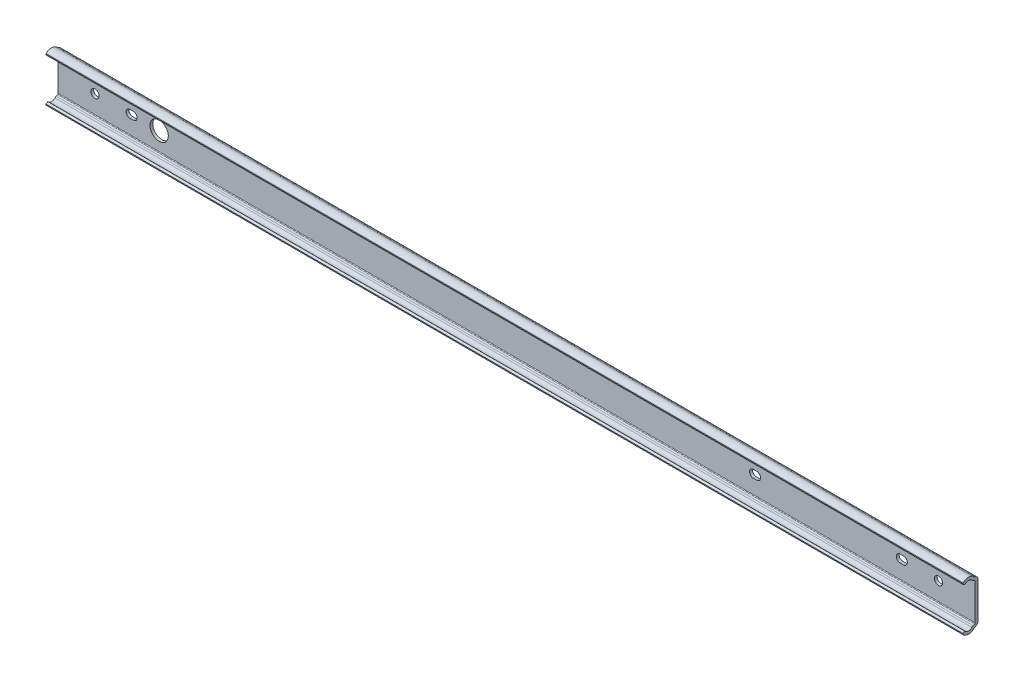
ISO-10303-21;
HEADER;
FILE_DESCRIPTION(('STEP AP214'),'2;1');
FILE_NAME('part.step','',(''),(''),'','','');
FILE_SCHEMA(('AUTOMOTIVE_DESIGN { 1 0 10303 214 1 1 1 1 }'));
ENDSEC;
DATA;
#1=APPLICATION_CONTEXT('core data for automotive mechanical design processes');
#2=APPLICATION_PROTOCOL_DEFINITION('international standard','automotive_design',2000,#1);
#3=PRODUCT_CONTEXT('',#1,'mechanical');
#4=PRODUCT('Part','Part','',(#3));
#5=PRODUCT_RELATED_PRODUCT_CATEGORY('part','',(#4));
#6=PRODUCT_DEFINITION_FORMATION('','',#4);
#7=PRODUCT_DEFINITION_CONTEXT('part definition',#1,'design');
#8=PRODUCT_DEFINITION('design','',#6,#7);
#9=PRODUCT_DEFINITION_SHAPE('','',#8);
#10=(LENGTH_UNIT() NAMED_UNIT(*) SI_UNIT(.MILLI.,.METRE.));
#11=(NAMED_UNIT(*) PLANE_ANGLE_UNIT() SI_UNIT($,.RADIAN.));
#12=(NAMED_UNIT(*) SI_UNIT($,.STERADIAN.) SOLID_ANGLE_UNIT());
#13=UNCERTAINTY_MEASURE_WITH_UNIT(LENGTH_MEASURE(1.E-05),#10,'distance_accuracy_value','');
#14=(GEOMETRIC_REPRESENTATION_CONTEXT(3) GLOBAL_UNCERTAINTY_ASSIGNED_CONTEXT((#13)) GLOBAL_UNIT_ASSIGNED_CONTEXT((#10,
#11,#12)) REPRESENTATION_CONTEXT('',''));
#15=CARTESIAN_POINT('',(0.,0.,0.));
#16=DIRECTION('',(0.,0.,1.));
#17=DIRECTION('',(1.,0.,0.));
#18=AXIS2_PLACEMENT_3D('',#15,#16,#17);
#19=CARTESIAN_POINT('',(-20.,-9.85313472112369,0.));
#20=DIRECTION('',(0.,0.,1.));
#21=DIRECTION('',(1.,0.,0.));
#22=AXIS2_PLACEMENT_3D('',#19,#20,#21);
#23=PLANE('',#22);
#24=DIRECTION('',(1.,0.,0.));
#25=VECTOR('',#24,1.);
#26=CARTESIAN_POINT('',(-20.,-2.10000022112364,0.));
#27=LINE('',#26,#25);
#28=CARTESIAN_POINT('',(439.1,-2.10000022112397,0.));
#29=VERTEX_POINT('',#28);
#30=CARTESIAN_POINT('',(440.9,-2.10000022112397,0.));
#31=VERTEX_POINT('',#30);
#32=EDGE_CURVE('E291',#29,#31,#27,.T.);
#33=ORIENTED_EDGE('',*,*,#32,.T.);
#34=CARTESIAN_POINT('',(440.9,-2.21123962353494E-07,0.));
#35=DIRECTION('',(0.,0.,1.));
#36=DIRECTION('',(1.,0.,0.));
#37=AXIS2_PLACEMENT_3D('',#34,#35,#36);
#38=CIRCLE('',#37,2.10000000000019);
#39=CARTESIAN_POINT('',(440.9,2.0999997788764,0.));
#40=VERTEX_POINT('',#39);
#41=EDGE_CURVE('E294',#31,#40,#38,.T.);
#42=ORIENTED_EDGE('',*,*,#41,.T.);
#43=DIRECTION('',(-1.,0.,0.));
#44=VECTOR('',#43,1.);
#45=CARTESIAN_POINT('',(-20.,2.09999977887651,0.));
#46=LINE('',#45,#44);
#47=CARTESIAN_POINT('',(439.1,2.0999997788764,0.));
#48=VERTEX_POINT('',#47);
#49=EDGE_CURVE('E286',#40,#48,#46,.T.);
#50=ORIENTED_EDGE('',*,*,#49,.T.);
#51=CARTESIAN_POINT('',(439.1,-2.2112396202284E-07,0.));
#52=DIRECTION('',(0.,0.,1.));
#53=DIRECTION('',(1.,0.,0.));
#54=AXIS2_PLACEMENT_3D('',#51,#52,#53);
#55=CIRCLE('',#54,2.10000000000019);
#56=EDGE_CURVE('E266',#48,#29,#55,.T.);
#57=ORIENTED_EDGE('',*,*,#56,.T.);
#58=EDGE_LOOP('',(#33,#42,#50,#57));
#59=FACE_BOUND('',#58,.T.);
#60=DIRECTION('',(1.,0.,0.));
#61=VECTOR('',#60,1.);
#62=CARTESIAN_POINT('',(-20.,-9.85313472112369,0.));
#63=LINE('',#62,#61);
#64=CARTESIAN_POINT('',(-20.,-9.85313472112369,0.));
#65=VERTEX_POINT('',#64);
#66=CARTESIAN_POINT('',(480.,-9.85313472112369,0.));
#67=VERTEX_POINT('',#66);
#68=EDGE_CURVE('E502',#65,#67,#63,.T.);
#69=ORIENTED_EDGE('',*,*,#68,.F.);
#70=DIRECTION('',(0.,-1.,0.));
#71=VECTOR('',#70,1.);
#72=CARTESIAN_POINT('',(-20.,-9.85313472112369,0.));
#73=LINE('',#72,#71);
#74=CARTESIAN_POINT('',(-20.,9.85313427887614,0.));
#75=VERTEX_POINT('',#74);
#76=EDGE_CURVE('E420',#75,#65,#73,.T.);
#77=ORIENTED_EDGE('',*,*,#76,.F.);
#78=DIRECTION('',(1.,0.,0.));
#79=VECTOR('',#78,1.);
#80=CARTESIAN_POINT('',(-20.,9.85313427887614,0.));
#81=LINE('',#80,#79);
#82=CARTESIAN_POINT('',(480.,9.85313427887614,0.));
#83=VERTEX_POINT('',#82);
#84=EDGE_CURVE('E505',#75,#83,#81,.T.);
#85=ORIENTED_EDGE('',*,*,#84,.T.);
#86=DIRECTION('',(0.,-1.,0.));
#87=VECTOR('',#86,1.);
#88=CARTESIAN_POINT('',(480.,-9.85313472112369,0.));
#89=LINE('',#88,#87);
#90=EDGE_CURVE('E367',#83,#67,#89,.T.);
#91=ORIENTED_EDGE('',*,*,#90,.T.);
#92=EDGE_LOOP('',(#69,#77,#85,#91));
#93=FACE_BOUND('',#92,.T.);
#94=CARTESIAN_POINT('',(35.,0.,0.));
#95=DIRECTION('',(0.,0.,-1.));
#96=DIRECTION('',(-1.,0.,0.));
#97=AXIS2_PLACEMENT_3D('',#94,#95,#96);
#98=CIRCLE('',#97,5.);
#99=CARTESIAN_POINT('',(30.,0.,0.));
#100=VERTEX_POINT('',#99);
#101=EDGE_CURVE('E297',#100,#100,#98,.T.);
#102=ORIENTED_EDGE('',*,*,#101,.F.);
#103=EDGE_LOOP('',(#102));
#104=FACE_BOUND('',#103,.T.);
#105=DIRECTION('',(-1.,0.,0.));
#106=VECTOR('',#105,1.);
#107=CARTESIAN_POINT('',(20.9,-2.1,0.));
#108=LINE('',#107,#106);
#109=CARTESIAN_POINT('',(20.9,-2.1,0.));
#110=VERTEX_POINT('',#109);
#111=CARTESIAN_POINT('',(19.1,-2.1,0.));
#112=VERTEX_POINT('',#111);
#113=EDGE_CURVE('E302',#110,#112,#108,.T.);
#114=ORIENTED_EDGE('',*,*,#113,.F.);
#115=CARTESIAN_POINT('',(20.9,0.,0.));
#116=DIRECTION('',(0.,0.,-1.));
#117=DIRECTION('',(-1.,0.,0.));
#118=AXIS2_PLACEMENT_3D('',#115,#116,#117);
#119=CIRCLE('',#118,2.1);
#120=CARTESIAN_POINT('',(20.9,2.1,0.));
#121=VERTEX_POINT('',#120);
#122=EDGE_CURVE('E300',#121,#110,#119,.T.);
#123=ORIENTED_EDGE('',*,*,#122,.F.);
#124=DIRECTION('',(1.,0.,0.));
#125=VECTOR('',#124,1.);
#126=CARTESIAN_POINT('',(20.9,2.1,0.));
#127=LINE('',#126,#125);
#128=CARTESIAN_POINT('',(19.1,2.1,0.));
#129=VERTEX_POINT('',#128);
#130=EDGE_CURVE('E308',#129,#121,#127,.T.);
#131=ORIENTED_EDGE('',*,*,#130,.F.);
#132=CARTESIAN_POINT('',(19.1,0.,0.));
#133=DIRECTION('',(0.,0.,-1.));
#134=DIRECTION('',(-1.,0.,0.));
#135=AXIS2_PLACEMENT_3D('',#132,#133,#134);
#136=CIRCLE('',#135,2.1);
#137=EDGE_CURVE('E305',#112,#129,#136,.T.);
#138=ORIENTED_EDGE('',*,*,#137,.F.);
#139=EDGE_LOOP('',(#114,#123,#131,#138));
#140=FACE_BOUND('',#139,.T.);
#141=DIRECTION('',(-1.,0.,0.));
#142=VECTOR('',#141,1.);
#143=CARTESIAN_POINT('',(360.9,-2.10000000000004,0.));
#144=LINE('',#143,#142);
#145=CARTESIAN_POINT('',(360.9,-2.10000000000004,0.));
#146=VERTEX_POINT('',#145);
#147=CARTESIAN_POINT('',(359.1,-2.10000000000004,0.));
#148=VERTEX_POINT('',#147);
#149=EDGE_CURVE('E322',#146,#148,#144,.T.);
#150=ORIENTED_EDGE('',*,*,#149,.F.);
#151=CARTESIAN_POINT('',(360.9,0.,0.));
#152=DIRECTION('',(0.,0.,-1.));
#153=DIRECTION('',(-1.,0.,0.));
#154=AXIS2_PLACEMENT_3D('',#151,#152,#153);
#155=CIRCLE('',#154,2.1);
#156=CARTESIAN_POINT('',(360.9,2.09999999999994,0.));
#157=VERTEX_POINT('',#156);
#158=EDGE_CURVE('E314',#157,#146,#155,.T.);
#159=ORIENTED_EDGE('',*,*,#158,.F.);
#160=DIRECTION('',(1.,0.,0.));
#161=VECTOR('',#160,1.);
#162=CARTESIAN_POINT('',(360.9,2.09999999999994,0.));
#163=LINE('',#162,#161);
#164=CARTESIAN_POINT('',(359.1,2.09999999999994,0.));
#165=VERTEX_POINT('',#164);
#166=EDGE_CURVE('E328',#165,#157,#163,.T.);
#167=ORIENTED_EDGE('',*,*,#166,.F.);
#168=CARTESIAN_POINT('',(359.1,0.,0.));
#169=DIRECTION('',(0.,0.,-1.));
#170=DIRECTION('',(-1.,0.,0.));
#171=AXIS2_PLACEMENT_3D('',#168,#169,#170);
#172=CIRCLE('',#171,2.1);
#173=EDGE_CURVE('E325',#148,#165,#172,.T.);
#174=ORIENTED_EDGE('',*,*,#173,.F.);
#175=EDGE_LOOP('',(#150,#159,#167,#174));
#176=FACE_BOUND('',#175,.T.);
#177=CARTESIAN_POINT('',(0.,0.,0.));
#178=DIRECTION('',(0.,0.,-1.));
#179=DIRECTION('',(-1.,0.,0.));
#180=AXIS2_PLACEMENT_3D('',#177,#178,#179);
#181=CIRCLE('',#180,2.24999999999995);
#182=CARTESIAN_POINT('',(-2.24999999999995,0.,0.));
#183=VERTEX_POINT('',#182);
#184=EDGE_CURVE('E334',#183,#183,#181,.T.);
#185=ORIENTED_EDGE('',*,*,#184,.F.);
#186=EDGE_LOOP('',(#185));
#187=FACE_BOUND('',#186,.T.);
#188=CARTESIAN_POINT('',(460.,0.,0.));
#189=DIRECTION('',(0.,0.,-1.));
#190=DIRECTION('',(-1.,0.,0.));
#191=AXIS2_PLACEMENT_3D('',#188,#189,#190);
#192=CIRCLE('',#191,2.25);
#193=CARTESIAN_POINT('',(457.75,0.,0.));
#194=VERTEX_POINT('',#193);
#195=EDGE_CURVE('E344',#194,#194,#192,.T.);
#196=ORIENTED_EDGE('',*,*,#195,.F.);
#197=EDGE_LOOP('',(#196));
#198=FACE_BOUND('',#197,.T.);
#199=ADVANCED_FACE('F14',(#59,#93,#104,#140,#176,#187,#198),#23,.F.);
#200=CARTESIAN_POINT('',(-20.,-9.85313472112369,1.54999999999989));
#201=DIRECTION('',(0.,0.,-1.));
#202=DIRECTION('',(-1.,0.,0.));
#203=AXIS2_PLACEMENT_3D('',#200,#201,#202);
#204=PLANE('',#203);
#205=DIRECTION('',(-1.,0.,0.));
#206=VECTOR('',#205,1.);
#207=CARTESIAN_POINT('',(440.9,2.0999997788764,1.54999999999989));
#208=LINE('',#207,#206);
#209=CARTESIAN_POINT('',(440.9,2.0999997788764,1.54999999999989));
#210=VERTEX_POINT('',#209);
#211=CARTESIAN_POINT('',(439.1,2.09999977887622,1.54999999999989));
#212=VERTEX_POINT('',#211);
#213=EDGE_CURVE('E272',#210,#212,#208,.T.);
#214=ORIENTED_EDGE('',*,*,#213,.F.);
#215=CARTESIAN_POINT('',(440.9,-2.21123962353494E-07,1.54999999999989));
#216=DIRECTION('',(0.,0.,1.));
#217=DIRECTION('',(1.,0.,0.));
#218=AXIS2_PLACEMENT_3D('',#215,#216,#217);
#219=CIRCLE('',#218,2.10000000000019);
#220=CARTESIAN_POINT('',(440.9,-2.10000022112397,1.54999999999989));
#221=VERTEX_POINT('',#220);
#222=EDGE_CURVE('E38',#221,#210,#219,.T.);
#223=ORIENTED_EDGE('',*,*,#222,.F.);
#224=DIRECTION('',(1.,0.,0.));
#225=VECTOR('',#224,1.);
#226=CARTESIAN_POINT('',(440.9,-2.10000022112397,1.54999999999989));
#227=LINE('',#226,#225);
#228=CARTESIAN_POINT('',(439.1,-2.10000022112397,1.54999999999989));
#229=VERTEX_POINT('',#228);
#230=EDGE_CURVE('E279',#229,#221,#227,.T.);
#231=ORIENTED_EDGE('',*,*,#230,.F.);
#232=CARTESIAN_POINT('',(439.1,-2.2112396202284E-07,1.54999999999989));
#233=DIRECTION('',(0.,0.,1.));
#234=DIRECTION('',(1.,0.,0.));
#235=AXIS2_PLACEMENT_3D('',#232,#233,#234);
#236=CIRCLE('',#235,2.10000000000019);
#237=EDGE_CURVE('E263',#212,#229,#236,.T.);
#238=ORIENTED_EDGE('',*,*,#237,.F.);
#239=EDGE_LOOP('',(#214,#223,#231,#238));
#240=FACE_BOUND('',#239,.T.);
#241=CARTESIAN_POINT('',(35.,0.,1.54999999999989));
#242=DIRECTION('',(0.,0.,-1.));
#243=DIRECTION('',(-1.,0.,0.));
#244=AXIS2_PLACEMENT_3D('',#241,#242,#243);
#245=CIRCLE('',#244,5.);
#246=CARTESIAN_POINT('',(30.,0.,1.54999999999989));
#247=VERTEX_POINT('',#246);
#248=EDGE_CURVE('E18',#247,#247,#245,.T.);
#249=ORIENTED_EDGE('',*,*,#248,.T.);
#250=EDGE_LOOP('',(#249));
#251=FACE_BOUND('',#250,.T.);
#252=DIRECTION('',(1.,0.,0.));
#253=VECTOR('',#252,1.);
#254=CARTESIAN_POINT('',(-20.,2.1,1.54999999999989));
#255=LINE('',#254,#253);
#256=CARTESIAN_POINT('',(19.1,2.1,1.54999999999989));
#257=VERTEX_POINT('',#256);
#258=CARTESIAN_POINT('',(20.9,2.1,1.54999999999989));
#259=VERTEX_POINT('',#258);
#260=EDGE_CURVE('E23',#257,#259,#255,.T.);
#261=ORIENTED_EDGE('',*,*,#260,.T.);
#262=CARTESIAN_POINT('',(20.9,0.,1.54999999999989));
#263=DIRECTION('',(0.,0.,-1.));
#264=DIRECTION('',(-1.,0.,0.));
#265=AXIS2_PLACEMENT_3D('',#262,#263,#264);
#266=CIRCLE('',#265,2.1);
#267=CARTESIAN_POINT('',(20.9,-2.1,1.54999999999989));
#268=VERTEX_POINT('',#267);
#269=EDGE_CURVE('E9',#259,#268,#266,.T.);
#270=ORIENTED_EDGE('',*,*,#269,.T.);
#271=DIRECTION('',(-1.,0.,0.));
#272=VECTOR('',#271,1.);
#273=CARTESIAN_POINT('',(-20.,-2.1,1.54999999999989));
#274=LINE('',#273,#272);
#275=CARTESIAN_POINT('',(19.1,-2.1,1.54999999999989));
#276=VERTEX_POINT('',#275);
#277=EDGE_CURVE('E548',#268,#276,#274,.T.);
#278=ORIENTED_EDGE('',*,*,#277,.T.);
#279=CARTESIAN_POINT('',(19.1,0.,1.54999999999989));
#280=DIRECTION('',(0.,0.,-1.));
#281=DIRECTION('',(-1.,0.,0.));
#282=AXIS2_PLACEMENT_3D('',#279,#280,#281);
#283=CIRCLE('',#282,2.1);
#284=EDGE_CURVE('E551',#276,#257,#283,.T.);
#285=ORIENTED_EDGE('',*,*,#284,.T.);
#286=EDGE_LOOP('',(#261,#270,#278,#285));
#287=FACE_BOUND('',#286,.T.);
#288=DIRECTION('',(1.,0.,0.));
#289=VECTOR('',#288,1.);
#290=CARTESIAN_POINT('',(-20.,2.09999999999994,1.54999999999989));
#291=LINE('',#290,#289);
#292=CARTESIAN_POINT('',(359.1,2.09999999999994,1.54999999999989));
#293=VERTEX_POINT('',#292);
#294=CARTESIAN_POINT('',(360.9,2.09999999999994,1.54999999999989));
#295=VERTEX_POINT('',#294);
#296=EDGE_CURVE('E542',#293,#295,#291,.T.);
#297=ORIENTED_EDGE('',*,*,#296,.T.);
#298=CARTESIAN_POINT('',(360.9,0.,1.54999999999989));
#299=DIRECTION('',(0.,0.,-1.));
#300=DIRECTION('',(-1.,0.,0.));
#301=AXIS2_PLACEMENT_3D('',#298,#299,#300);
#302=CIRCLE('',#301,2.1);
#303=CARTESIAN_POINT('',(360.9,-2.10000000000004,1.54999999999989));
#304=VERTEX_POINT('',#303);
#305=EDGE_CURVE('E545',#295,#304,#302,.T.);
#306=ORIENTED_EDGE('',*,*,#305,.T.);
#307=DIRECTION('',(-1.,0.,0.));
#308=VECTOR('',#307,1.);
#309=CARTESIAN_POINT('',(-20.,-2.10000000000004,1.54999999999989));
#310=LINE('',#309,#308);
#311=CARTESIAN_POINT('',(359.1,-2.10000000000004,1.54999999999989));
#312=VERTEX_POINT('',#311);
#313=EDGE_CURVE('E532',#304,#312,#310,.T.);
#314=ORIENTED_EDGE('',*,*,#313,.T.);
#315=CARTESIAN_POINT('',(359.1,0.,1.54999999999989));
#316=DIRECTION('',(0.,0.,-1.));
#317=DIRECTION('',(-1.,0.,0.));
#318=AXIS2_PLACEMENT_3D('',#315,#316,#317);
#319=CIRCLE('',#318,2.1);
#320=EDGE_CURVE('E539',#312,#293,#319,.T.);
#321=ORIENTED_EDGE('',*,*,#320,.T.);
#322=EDGE_LOOP('',(#297,#306,#314,#321));
#323=FACE_BOUND('',#322,.T.);
#324=CARTESIAN_POINT('',(0.,0.,1.54999999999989));
#325=DIRECTION('',(0.,0.,-1.));
#326=DIRECTION('',(-1.,0.,0.));
#327=AXIS2_PLACEMENT_3D('',#324,#325,#326);
#328=CIRCLE('',#327,2.24999999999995);
#329=CARTESIAN_POINT('',(-2.24999999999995,0.,1.54999999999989));
#330=VERTEX_POINT('',#329);
#331=EDGE_CURVE('E343',#330,#330,#328,.T.);
#332=ORIENTED_EDGE('',*,*,#331,.T.);
#333=EDGE_LOOP('',(#332));
#334=FACE_BOUND('',#333,.T.);
#335=CARTESIAN_POINT('',(460.,0.,1.54999999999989));
#336=DIRECTION('',(0.,0.,-1.));
#337=DIRECTION('',(-1.,0.,0.));
#338=AXIS2_PLACEMENT_3D('',#335,#336,#337);
#339=CIRCLE('',#338,2.25);
#340=CARTESIAN_POINT('',(457.75,0.,1.54999999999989));
#341=VERTEX_POINT('',#340);
#342=EDGE_CURVE('E347',#341,#341,#339,.T.);
#343=ORIENTED_EDGE('',*,*,#342,.T.);
#344=EDGE_LOOP('',(#343));
#345=FACE_BOUND('',#344,.T.);
#346=DIRECTION('',(1.,0.,0.));
#347=VECTOR('',#346,1.);
#348=CARTESIAN_POINT('',(-20.,9.85313427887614,1.54999999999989));
#349=LINE('',#348,#347);
#350=CARTESIAN_POINT('',(-20.,9.85313427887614,1.54999999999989));
#351=VERTEX_POINT('',#350);
#352=CARTESIAN_POINT('',(480.,9.85313427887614,1.54999999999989));
#353=VERTEX_POINT('',#352);
#354=EDGE_CURVE('E463',#351,#353,#349,.T.);
#355=ORIENTED_EDGE('',*,*,#354,.F.);
#356=DIRECTION('',(0.,1.,0.));
#357=VECTOR('',#356,1.);
#358=CARTESIAN_POINT('',(-20.,-9.85313472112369,1.54999999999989));
#359=LINE('',#358,#357);
#360=CARTESIAN_POINT('',(-20.,-9.85313472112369,1.54999999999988));
#361=VERTEX_POINT('',#360);
#362=EDGE_CURVE('E446',#361,#351,#359,.T.);
#363=ORIENTED_EDGE('',*,*,#362,.F.);
#364=DIRECTION('',(1.,0.,0.));
#365=VECTOR('',#364,1.);
#366=CARTESIAN_POINT('',(-20.,-9.85313472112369,1.54999999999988));
#367=LINE('',#366,#365);
#368=CARTESIAN_POINT('',(480.,-9.85313472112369,1.54999999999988));
#369=VERTEX_POINT('',#368);
#370=EDGE_CURVE('E466',#361,#369,#367,.T.);
#371=ORIENTED_EDGE('',*,*,#370,.T.);
#372=DIRECTION('',(0.,1.,0.));
#373=VECTOR('',#372,1.);
#374=CARTESIAN_POINT('',(480.,-9.85313472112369,1.54999999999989));
#375=LINE('',#374,#373);
#376=EDGE_CURVE('E393',#369,#353,#375,.T.);
#377=ORIENTED_EDGE('',*,*,#376,.T.);
#378=EDGE_LOOP('',(#355,#363,#371,#377));
#379=FACE_BOUND('',#378,.T.);
#380=ADVANCED_FACE('F276',(#240,#251,#287,#323,#334,#345,#379),#204,.F.);
#381=CARTESIAN_POINT('',(-20.,9.47,5.19000063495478));
#382=DIRECTION('',(-1.,0.,0.));
#383=DIRECTION('',(0.,0.,1.));
#384=AXIS2_PLACEMENT_3D('',#381,#382,#383);
#385=PLANE('',#384);
#386=ORIENTED_EDGE('',*,*,#362,.T.);
#387=CARTESIAN_POINT('',(-20.,9.85313427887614,2.05000034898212));
#388=DIRECTION('',(1.,0.,0.));
#389=DIRECTION('',(0.,0.,1.));
#390=AXIS2_PLACEMENT_3D('',#387,#388,#389);
#391=CIRCLE('',#390,0.500000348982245);
#392=CARTESIAN_POINT('',(-20.,10.3133869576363,1.85463448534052));
#393=VERTEX_POINT('',#392);
#394=EDGE_CURVE('E448',#351,#393,#391,.T.);
#395=ORIENTED_EDGE('',*,*,#394,.T.);
#396=DIRECTION('',(0.,0.39073096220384,0.920504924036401));
#397=VECTOR('',#396,1.);
#398=CARTESIAN_POINT('',(-20.,10.6566650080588,2.66334729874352));
#399=LINE('',#398,#397);
#400=CARTESIAN_POINT('',(-20.,10.6566650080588,2.66334729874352));
#401=VERTEX_POINT('',#400);
#402=EDGE_CURVE('E450',#393,#401,#399,.T.);
#403=ORIENTED_EDGE('',*,*,#402,.T.);
#404=CARTESIAN_POINT('',(-20.,12.5437002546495,1.86234835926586));
#405=DIRECTION('',(-1.,0.,0.));
#406=DIRECTION('',(0.,0.,1.));
#407=AXIS2_PLACEMENT_3D('',#404,#405,#406);
#408=CIRCLE('',#407,2.05000032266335);
#409=CARTESIAN_POINT('',(-20.,11.152732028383,3.36823969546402));
#410=VERTEX_POINT('',#409);
#411=EDGE_CURVE('E452',#401,#410,#408,.T.);
#412=ORIENTED_EDGE('',*,*,#411,.T.);
#413=CARTESIAN_POINT('',(-20.,9.47,5.19000063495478));
#414=DIRECTION('',(1.,0.,0.));
#415=DIRECTION('',(0.,0.,1.));
#416=AXIS2_PLACEMENT_3D('',#413,#414,#415);
#417=CIRCLE('',#416,2.48);
#418=CARTESIAN_POINT('',(-20.,11.2236248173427,6.94362545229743));
#419=VERTEX_POINT('',#418);
#420=EDGE_CURVE('E401',#410,#419,#417,.T.);
#421=ORIENTED_EDGE('',*,*,#420,.T.);
#422=DIRECTION('',(0.,-0.707107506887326,0.707106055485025));
#423=VECTOR('',#422,1.);
#424=CARTESIAN_POINT('',(-20.,11.2236248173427,6.94362545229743));
#425=LINE('',#424,#423);
#426=CARTESIAN_POINT('',(-20.,10.914413,7.2528366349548));
#427=VERTEX_POINT('',#426);
#428=EDGE_CURVE('E404',#419,#427,#425,.T.);
#429=ORIENTED_EDGE('',*,*,#428,.T.);
#430=DIRECTION('',(0.,0.573576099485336,0.819152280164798));
#431=VECTOR('',#430,1.);
#432=CARTESIAN_POINT('',(-20.,10.914413,7.2528366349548));
#433=LINE('',#432,#431);
#434=CARTESIAN_POINT('',(-20.,11.59863,8.23000063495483));
#435=VERTEX_POINT('',#434);
#436=EDGE_CURVE('E406',#427,#435,#433,.T.);
#437=ORIENTED_EDGE('',*,*,#436,.T.);
#438=DIRECTION('',(0.,1.,-2.09219452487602E-13));
#439=VECTOR('',#438,1.);
#440=CARTESIAN_POINT('',(-20.,12.1292799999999,8.23000063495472));
#441=LINE('',#440,#439);
#442=CARTESIAN_POINT('',(-20.,12.1292799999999,8.23000063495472));
#443=VERTEX_POINT('',#442);
#444=EDGE_CURVE('E408',#435,#443,#441,.T.);
#445=ORIENTED_EDGE('',*,*,#444,.T.);
#446=DIRECTION('',(0.,0.707108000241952,-0.707105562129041));
#447=VECTOR('',#446,1.);
#448=CARTESIAN_POINT('',(-20.,12.3196403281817,8.03964096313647));
#449=LINE('',#448,#447);
#450=CARTESIAN_POINT('',(-20.,12.3196403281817,8.03964096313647));
#451=VERTEX_POINT('',#450);
#452=EDGE_CURVE('E410',#443,#451,#449,.T.);
#453=ORIENTED_EDGE('',*,*,#452,.T.);
#454=CARTESIAN_POINT('',(-20.,9.47,5.19000063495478));
#455=DIRECTION('',(-1.,0.,0.));
#456=DIRECTION('',(0.,0.,1.));
#457=AXIS2_PLACEMENT_3D('',#454,#455,#456);
#458=CIRCLE('',#457,4.02999999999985);
#459=CARTESIAN_POINT('',(-20.,12.2044395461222,2.22963910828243));
#460=VERTEX_POINT('',#459);
#461=EDGE_CURVE('E412',#451,#460,#458,.T.);
#462=ORIENTED_EDGE('',*,*,#461,.T.);
#463=CARTESIAN_POINT('',(-20.,12.5437002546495,1.86234835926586));
#464=DIRECTION('',(1.,0.,0.));
#465=DIRECTION('',(0.,0.,1.));
#466=AXIS2_PLACEMENT_3D('',#463,#464,#465);
#467=CIRCLE('',#466,0.500000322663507);
#468=CARTESIAN_POINT('',(-20.,12.0834476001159,2.05771421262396));
#469=VERTEX_POINT('',#468);
#470=EDGE_CURVE('E414',#460,#469,#467,.T.);
#471=ORIENTED_EDGE('',*,*,#470,.T.);
#472=DIRECTION('',(0.,-0.39073096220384,-0.920504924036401));
#473=VECTOR('',#472,1.);
#474=CARTESIAN_POINT('',(-20.,12.0834476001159,2.05771421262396));
#475=LINE('',#474,#473);
#476=CARTESIAN_POINT('',(-20.,11.7401695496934,1.24900139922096));
#477=VERTEX_POINT('',#476);
#478=EDGE_CURVE('E416',#469,#477,#475,.T.);
#479=ORIENTED_EDGE('',*,*,#478,.T.);
#480=CARTESIAN_POINT('',(-20.,9.85313427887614,2.05000034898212));
#481=DIRECTION('',(-1.,0.,0.));
#482=DIRECTION('',(0.,0.,1.));
#483=AXIS2_PLACEMENT_3D('',#480,#481,#482);
#484=CIRCLE('',#483,2.05000034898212);
#485=EDGE_CURVE('E418',#477,#75,#484,.T.);
#486=ORIENTED_EDGE('',*,*,#485,.T.);
#487=ORIENTED_EDGE('',*,*,#76,.T.);
#488=CARTESIAN_POINT('',(-20.,-9.85313472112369,2.05000034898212));
#489=DIRECTION('',(-1.,0.,0.));
#490=DIRECTION('',(0.,0.,-1.));
#491=AXIS2_PLACEMENT_3D('',#488,#489,#490);
#492=CIRCLE('',#491,2.05000034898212);
#493=CARTESIAN_POINT('',(-20.,-11.7401699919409,1.24900139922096));
#494=VERTEX_POINT('',#493);
#495=EDGE_CURVE('E422',#65,#494,#492,.T.);
#496=ORIENTED_EDGE('',*,*,#495,.T.);
#497=DIRECTION('',(0.,-0.39073096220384,0.920504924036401));
#498=VECTOR('',#497,1.);
#499=CARTESIAN_POINT('',(-20.,-12.0834480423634,2.05771421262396));
#500=LINE('',#499,#498);
#501=CARTESIAN_POINT('',(-20.,-12.0834480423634,2.05771421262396));
#502=VERTEX_POINT('',#501);
#503=EDGE_CURVE('E424',#494,#502,#500,.T.);
#504=ORIENTED_EDGE('',*,*,#503,.T.);
#505=CARTESIAN_POINT('',(-20.,-12.5437006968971,1.86234835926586));
#506=DIRECTION('',(1.,0.,0.));
#507=DIRECTION('',(0.,0.,-1.));
#508=AXIS2_PLACEMENT_3D('',#505,#506,#507);
#509=CIRCLE('',#508,0.500000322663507);
#510=CARTESIAN_POINT('',(-20.,-12.2044399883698,2.22963910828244));
#511=VERTEX_POINT('',#510);
#512=EDGE_CURVE('E426',#502,#511,#509,.T.);
#513=ORIENTED_EDGE('',*,*,#512,.T.);
#514=CARTESIAN_POINT('',(-20.,-9.4700004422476,5.19000063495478));
#515=DIRECTION('',(-1.,0.,0.));
#516=DIRECTION('',(0.,0.,-1.));
#517=AXIS2_PLACEMENT_3D('',#514,#515,#516);
#518=CIRCLE('',#517,4.02999999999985);
#519=CARTESIAN_POINT('',(-20.,-12.3196407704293,8.03964096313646));
#520=VERTEX_POINT('',#519);
#521=EDGE_CURVE('E428',#511,#520,#518,.T.);
#522=ORIENTED_EDGE('',*,*,#521,.T.);
#523=DIRECTION('',(0.,0.707108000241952,0.707105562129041));
#524=VECTOR('',#523,1.);
#525=CARTESIAN_POINT('',(-20.,-12.3196407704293,8.03964096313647));
#526=LINE('',#525,#524);
#527=CARTESIAN_POINT('',(-20.,-12.1292804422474,8.23000063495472));
#528=VERTEX_POINT('',#527);
#529=EDGE_CURVE('E430',#520,#528,#526,.T.);
#530=ORIENTED_EDGE('',*,*,#529,.T.);
#531=DIRECTION('',(0.,1.,2.09219452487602E-13));
#532=VECTOR('',#531,1.);
#533=CARTESIAN_POINT('',(-20.,-12.1292804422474,8.23000063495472));
#534=LINE('',#533,#532);
#535=CARTESIAN_POINT('',(-20.,-11.5986304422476,8.23000063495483));
#536=VERTEX_POINT('',#535);
#537=EDGE_CURVE('E432',#528,#536,#534,.T.);
#538=ORIENTED_EDGE('',*,*,#537,.T.);
#539=DIRECTION('',(0.,0.573576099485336,-0.819152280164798));
#540=VECTOR('',#539,1.);
#541=CARTESIAN_POINT('',(-20.,-10.9144134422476,7.2528366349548));
#542=LINE('',#541,#540);
#543=CARTESIAN_POINT('',(-20.,-10.9144134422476,7.2528366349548));
#544=VERTEX_POINT('',#543);
#545=EDGE_CURVE('E434',#536,#544,#542,.T.);
#546=ORIENTED_EDGE('',*,*,#545,.T.);
#547=DIRECTION('',(0.,-0.707107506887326,-0.707106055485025));
#548=VECTOR('',#547,1.);
#549=CARTESIAN_POINT('',(-20.,-11.2236252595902,6.94362545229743));
#550=LINE('',#549,#548);
#551=CARTESIAN_POINT('',(-20.,-11.2236252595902,6.94362545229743));
#552=VERTEX_POINT('',#551);
#553=EDGE_CURVE('E436',#544,#552,#550,.T.);
#554=ORIENTED_EDGE('',*,*,#553,.T.);
#555=CARTESIAN_POINT('',(-20.,-9.4700004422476,5.19000063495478));
#556=DIRECTION('',(1.,0.,0.));
#557=DIRECTION('',(0.,0.,-1.));
#558=AXIS2_PLACEMENT_3D('',#555,#556,#557);
#559=CIRCLE('',#558,2.48);
#560=CARTESIAN_POINT('',(-20.,-11.1527324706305,3.36823969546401));
#561=VERTEX_POINT('',#560);
#562=EDGE_CURVE('E438',#552,#561,#559,.T.);
#563=ORIENTED_EDGE('',*,*,#562,.T.);
#564=CARTESIAN_POINT('',(-20.,-12.5437006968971,1.86234835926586));
#565=DIRECTION('',(-1.,0.,0.));
#566=DIRECTION('',(0.,0.,-1.));
#567=AXIS2_PLACEMENT_3D('',#564,#565,#566);
#568=CIRCLE('',#567,2.05000032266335);
#569=CARTESIAN_POINT('',(-20.,-10.6566654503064,2.66334729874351));
#570=VERTEX_POINT('',#569);
#571=EDGE_CURVE('E440',#561,#570,#568,.T.);
#572=ORIENTED_EDGE('',*,*,#571,.T.);
#573=DIRECTION('',(0.,0.39073096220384,-0.920504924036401));
#574=VECTOR('',#573,1.);
#575=CARTESIAN_POINT('',(-20.,-10.6566654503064,2.66334729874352));
#576=LINE('',#575,#574);
#577=CARTESIAN_POINT('',(-20.,-10.3133873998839,1.85463448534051));
#578=VERTEX_POINT('',#577);
#579=EDGE_CURVE('E442',#570,#578,#576,.T.);
#580=ORIENTED_EDGE('',*,*,#579,.T.);
#581=CARTESIAN_POINT('',(-20.,-9.85313472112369,2.05000034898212));
#582=DIRECTION('',(1.,0.,0.));
#583=DIRECTION('',(0.,0.,-1.));
#584=AXIS2_PLACEMENT_3D('',#581,#582,#583);
#585=CIRCLE('',#584,0.500000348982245);
#586=EDGE_CURVE('E444',#578,#361,#585,.T.);
#587=ORIENTED_EDGE('',*,*,#586,.T.);
#588=EDGE_LOOP('',(#386,#395,#403,#412,#421,#429,#437,#445,#453,#462,#471,#479,#486,#487,#496,
#504,#513,#522,#530,#538,#546,#554,#563,#572,#580,#587));
#589=FACE_BOUND('',#588,.T.);
#590=ADVANCED_FACE('F596',(#589),#385,.T.);
#591=CARTESIAN_POINT('',(-20.,9.47,5.19000063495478));
#592=DIRECTION('',(1.,0.,0.));
#593=DIRECTION('',(0.,0.,-1.));
#594=AXIS2_PLACEMENT_3D('',#591,#592,#593);
#595=CYLINDRICAL_SURFACE('',#594,2.48);
#596=CARTESIAN_POINT('',(480.,9.47,5.19000063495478));
#597=DIRECTION('',(1.,0.,0.));
#598=DIRECTION('',(0.,0.,1.));
#599=AXIS2_PLACEMENT_3D('',#596,#597,#598);
#600=CIRCLE('',#599,2.48);
#601=CARTESIAN_POINT('',(480.,11.152732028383,3.36823969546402));
#602=VERTEX_POINT('',#601);
#603=CARTESIAN_POINT('',(480.,11.2236248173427,6.94362545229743));
#604=VERTEX_POINT('',#603);
#605=EDGE_CURVE('E348',#602,#604,#600,.T.);
#606=ORIENTED_EDGE('',*,*,#605,.T.);
#607=DIRECTION('',(1.,0.,0.));
#608=VECTOR('',#607,1.);
#609=CARTESIAN_POINT('',(-20.,11.2236248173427,6.94362545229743));
#610=LINE('',#609,#608);
#611=EDGE_CURVE('E529',#419,#604,#610,.T.);
#612=ORIENTED_EDGE('',*,*,#611,.F.);
#613=ORIENTED_EDGE('',*,*,#420,.F.);
#614=DIRECTION('',(1.,0.,0.));
#615=VECTOR('',#614,1.);
#616=CARTESIAN_POINT('',(-20.,11.152732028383,3.36823969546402));
#617=LINE('',#616,#615);
#618=EDGE_CURVE('E454',#410,#602,#617,.T.);
#619=ORIENTED_EDGE('',*,*,#618,.T.);
#620=EDGE_LOOP('',(#606,#612,#613,#619));
#621=FACE_BOUND('',#620,.T.);
#622=ADVANCED_FACE('F16',(#621),#595,.F.);
#623=CARTESIAN_POINT('',(-20.,11.2236248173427,6.94362545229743));
#624=DIRECTION('',(0.,0.707106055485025,0.707107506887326));
#625=DIRECTION('',(0.,0.707107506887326,-0.707106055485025));
#626=AXIS2_PLACEMENT_3D('',#623,#624,#625);
#627=PLANE('',#626);
#628=DIRECTION('',(0.,-0.707107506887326,0.707106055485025));
#629=VECTOR('',#628,1.);
#630=CARTESIAN_POINT('',(480.,11.2236248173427,6.94362545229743));
#631=LINE('',#630,#629);
#632=CARTESIAN_POINT('',(480.,10.914413,7.2528366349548));
#633=VERTEX_POINT('',#632);
#634=EDGE_CURVE('E351',#604,#633,#631,.T.);
#635=ORIENTED_EDGE('',*,*,#634,.T.);
#636=DIRECTION('',(1.,0.,0.));
#637=VECTOR('',#636,1.);
#638=CARTESIAN_POINT('',(-20.,10.914413,7.2528366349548));
#639=LINE('',#638,#637);
#640=EDGE_CURVE('E526',#427,#633,#639,.T.);
#641=ORIENTED_EDGE('',*,*,#640,.F.);
#642=ORIENTED_EDGE('',*,*,#428,.F.);
#643=ORIENTED_EDGE('',*,*,#611,.T.);
#644=EDGE_LOOP('',(#635,#641,#642,#643));
#645=FACE_BOUND('',#644,.T.);
#646=ADVANCED_FACE('F629',(#645),#627,.F.);
#647=CARTESIAN_POINT('',(-20.,10.914413,7.2528366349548));
#648=DIRECTION('',(0.,0.819152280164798,-0.573576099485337));
#649=DIRECTION('',(0.,-0.573576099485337,-0.819152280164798));
#650=AXIS2_PLACEMENT_3D('',#647,#648,#649);
#651=PLANE('',#650);
#652=DIRECTION('',(0.,0.573576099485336,0.819152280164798));
#653=VECTOR('',#652,1.);
#654=CARTESIAN_POINT('',(480.,10.914413,7.2528366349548));
#655=LINE('',#654,#653);
#656=CARTESIAN_POINT('',(480.,11.59863,8.23000063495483));
#657=VERTEX_POINT('',#656);
#658=EDGE_CURVE('E353',#633,#657,#655,.T.);
#659=ORIENTED_EDGE('',*,*,#658,.T.);
#660=DIRECTION('',(1.,0.,0.));
#661=VECTOR('',#660,1.);
#662=CARTESIAN_POINT('',(-20.,11.59863,8.23000063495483));
#663=LINE('',#662,#661);
#664=EDGE_CURVE('E523',#435,#657,#663,.T.);
#665=ORIENTED_EDGE('',*,*,#664,.F.);
#666=ORIENTED_EDGE('',*,*,#436,.F.);
#667=ORIENTED_EDGE('',*,*,#640,.T.);
#668=EDGE_LOOP('',(#659,#665,#666,#667));
#669=FACE_BOUND('',#668,.T.);
#670=ADVANCED_FACE('F626',(#669),#651,.F.);
#671=CARTESIAN_POINT('',(-20.,12.1292799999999,8.23000063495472));
#672=DIRECTION('',(0.,-2.09219452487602E-13,-1.));
#673=DIRECTION('',(0.,-1.,2.09219452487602E-13));
#674=AXIS2_PLACEMENT_3D('',#671,#672,#673);
#675=PLANE('',#674);
#676=DIRECTION('',(0.,1.,-2.09219452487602E-13));
#677=VECTOR('',#676,1.);
#678=CARTESIAN_POINT('',(480.,12.1292799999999,8.23000063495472));
#679=LINE('',#678,#677);
#680=CARTESIAN_POINT('',(480.,12.1292799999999,8.23000063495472));
#681=VERTEX_POINT('',#680);
#682=EDGE_CURVE('E355',#657,#681,#679,.T.);
#683=ORIENTED_EDGE('',*,*,#682,.T.);
#684=DIRECTION('',(1.,0.,0.));
#685=VECTOR('',#684,1.);
#686=CARTESIAN_POINT('',(-20.,12.1292799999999,8.23000063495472));
#687=LINE('',#686,#685);
#688=EDGE_CURVE('E520',#443,#681,#687,.T.);
#689=ORIENTED_EDGE('',*,*,#688,.F.);
#690=ORIENTED_EDGE('',*,*,#444,.F.);
#691=ORIENTED_EDGE('',*,*,#664,.T.);
#692=EDGE_LOOP('',(#683,#689,#690,#691));
#693=FACE_BOUND('',#692,.T.);
#694=ADVANCED_FACE('F622',(#693),#675,.F.);
#695=CARTESIAN_POINT('',(-20.,12.3196403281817,8.03964096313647));
#696=DIRECTION('',(0.,-0.707105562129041,-0.707108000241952));
#697=DIRECTION('',(0.,-0.707108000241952,0.707105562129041));
#698=AXIS2_PLACEMENT_3D('',#695,#696,#697);
#699=PLANE('',#698);
#700=DIRECTION('',(0.,0.707108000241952,-0.707105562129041));
#701=VECTOR('',#700,1.);
#702=CARTESIAN_POINT('',(480.,12.3196403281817,8.03964096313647));
#703=LINE('',#702,#701);
#704=CARTESIAN_POINT('',(480.,12.3196403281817,8.03964096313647));
#705=VERTEX_POINT('',#704);
#706=EDGE_CURVE('E357',#681,#705,#703,.T.);
#707=ORIENTED_EDGE('',*,*,#706,.T.);
#708=DIRECTION('',(1.,0.,0.));
#709=VECTOR('',#708,1.);
#710=CARTESIAN_POINT('',(-20.,12.3196403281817,8.03964096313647));
#711=LINE('',#710,#709);
#712=EDGE_CURVE('E517',#451,#705,#711,.T.);
#713=ORIENTED_EDGE('',*,*,#712,.F.);
#714=ORIENTED_EDGE('',*,*,#452,.F.);
#715=ORIENTED_EDGE('',*,*,#688,.T.);
#716=EDGE_LOOP('',(#707,#713,#714,#715));
#717=FACE_BOUND('',#716,.T.);
#718=ADVANCED_FACE('F618',(#717),#699,.F.);
#719=CARTESIAN_POINT('',(-20.,9.47,5.19000063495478));
#720=DIRECTION('',(1.,0.,0.));
#721=DIRECTION('',(0.,0.,-1.));
#722=AXIS2_PLACEMENT_3D('',#719,#720,#721);
#723=CYLINDRICAL_SURFACE('',#722,4.02999999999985);
#724=DIRECTION('',(1.,0.,0.));
#725=VECTOR('',#724,1.);
#726=CARTESIAN_POINT('',(-20.,12.2044395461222,2.22963910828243));
#727=LINE('',#726,#725);
#728=CARTESIAN_POINT('',(480.,12.2044395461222,2.22963910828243));
#729=VERTEX_POINT('',#728);
#730=EDGE_CURVE('E514',#460,#729,#727,.T.);
#731=ORIENTED_EDGE('',*,*,#730,.F.);
#732=ORIENTED_EDGE('',*,*,#461,.F.);
#733=ORIENTED_EDGE('',*,*,#712,.T.);
#734=CARTESIAN_POINT('',(480.,9.47,5.19000063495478));
#735=DIRECTION('',(-1.,0.,0.));
#736=DIRECTION('',(0.,0.,1.));
#737=AXIS2_PLACEMENT_3D('',#734,#735,#736);
#738=CIRCLE('',#737,4.02999999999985);
#739=EDGE_CURVE('E359',#705,#729,#738,.T.);
#740=ORIENTED_EDGE('',*,*,#739,.T.);
#741=EDGE_LOOP('',(#731,#732,#733,#740));
#742=FACE_BOUND('',#741,.T.);
#743=ADVANCED_FACE('F614',(#742),#723,.T.);
#744=CARTESIAN_POINT('',(-20.,12.5437002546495,1.86234835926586));
#745=DIRECTION('',(1.,0.,0.));
#746=DIRECTION('',(0.,0.,-1.));
#747=AXIS2_PLACEMENT_3D('',#744,#745,#746);
#748=CYLINDRICAL_SURFACE('',#747,0.500000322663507);
#749=CARTESIAN_POINT('',(480.,12.5437002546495,1.86234835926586));
#750=DIRECTION('',(1.,0.,0.));
#751=DIRECTION('',(0.,0.,1.));
#752=AXIS2_PLACEMENT_3D('',#749,#750,#751);
#753=CIRCLE('',#752,0.500000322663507);
#754=CARTESIAN_POINT('',(480.,12.0834476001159,2.05771421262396));
#755=VERTEX_POINT('',#754);
#756=EDGE_CURVE('E361',#729,#755,#753,.T.);
#757=ORIENTED_EDGE('',*,*,#756,.T.);
#758=DIRECTION('',(1.,0.,0.));
#759=VECTOR('',#758,1.);
#760=CARTESIAN_POINT('',(-20.,12.0834476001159,2.05771421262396));
#761=LINE('',#760,#759);
#762=EDGE_CURVE('E511',#469,#755,#761,.T.);
#763=ORIENTED_EDGE('',*,*,#762,.F.);
#764=ORIENTED_EDGE('',*,*,#470,.F.);
#765=ORIENTED_EDGE('',*,*,#730,.T.);
#766=EDGE_LOOP('',(#757,#763,#764,#765));
#767=FACE_BOUND('',#766,.T.);
#768=ADVANCED_FACE('F610',(#767),#748,.F.);
#769=CARTESIAN_POINT('',(-20.,12.0834476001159,2.05771421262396));
#770=DIRECTION('',(0.,-0.920504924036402,0.390730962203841));
#771=DIRECTION('',(0.,0.390730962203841,0.920504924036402));
#772=AXIS2_PLACEMENT_3D('',#769,#770,#771);
#773=PLANE('',#772);
#774=DIRECTION('',(0.,-0.39073096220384,-0.920504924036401));
#775=VECTOR('',#774,1.);
#776=CARTESIAN_POINT('',(480.,12.0834476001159,2.05771421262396));
#777=LINE('',#776,#775);
#778=CARTESIAN_POINT('',(480.,11.7401695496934,1.24900139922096));
#779=VERTEX_POINT('',#778);
#780=EDGE_CURVE('E363',#755,#779,#777,.T.);
#781=ORIENTED_EDGE('',*,*,#780,.T.);
#782=DIRECTION('',(1.,0.,0.));
#783=VECTOR('',#782,1.);
#784=CARTESIAN_POINT('',(-20.,11.7401695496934,1.24900139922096));
#785=LINE('',#784,#783);
#786=EDGE_CURVE('E508',#477,#779,#785,.T.);
#787=ORIENTED_EDGE('',*,*,#786,.F.);
#788=ORIENTED_EDGE('',*,*,#478,.F.);
#789=ORIENTED_EDGE('',*,*,#762,.T.);
#790=EDGE_LOOP('',(#781,#787,#788,#789));
#791=FACE_BOUND('',#790,.T.);
#792=ADVANCED_FACE('F606',(#791),#773,.F.);
#793=CARTESIAN_POINT('',(-20.,9.85313427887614,2.05000034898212));
#794=DIRECTION('',(1.,0.,0.));
#795=DIRECTION('',(0.,0.,-1.));
#796=AXIS2_PLACEMENT_3D('',#793,#794,#795);
#797=CYLINDRICAL_SURFACE('',#796,2.05000034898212);
#798=CARTESIAN_POINT('',(480.,9.85313427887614,2.05000034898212));
#799=DIRECTION('',(-1.,0.,0.));
#800=DIRECTION('',(0.,0.,1.));
#801=AXIS2_PLACEMENT_3D('',#798,#799,#800);
#802=CIRCLE('',#801,2.05000034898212);
#803=EDGE_CURVE('E365',#779,#83,#802,.T.);
#804=ORIENTED_EDGE('',*,*,#803,.T.);
#805=ORIENTED_EDGE('',*,*,#84,.F.);
#806=ORIENTED_EDGE('',*,*,#485,.F.);
#807=ORIENTED_EDGE('',*,*,#786,.T.);
#808=EDGE_LOOP('',(#804,#805,#806,#807));
#809=FACE_BOUND('',#808,.T.);
#810=ADVANCED_FACE('F603',(#809),#797,.T.);
#811=CARTESIAN_POINT('',(-20.,-9.85313472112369,2.05000034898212));
#812=DIRECTION('',(1.,0.,0.));
#813=DIRECTION('',(0.,0.,-1.));
#814=AXIS2_PLACEMENT_3D('',#811,#812,#813);
#815=CYLINDRICAL_SURFACE('',#814,2.05000034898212);
#816=CARTESIAN_POINT('',(480.,-9.85313472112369,2.05000034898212));
#817=DIRECTION('',(-1.,0.,0.));
#818=DIRECTION('',(0.,0.,-1.));
#819=AXIS2_PLACEMENT_3D('',#816,#817,#818);
#820=CIRCLE('',#819,2.05000034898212);
#821=CARTESIAN_POINT('',(480.,-11.7401699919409,1.24900139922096));
#822=VERTEX_POINT('',#821);
#823=EDGE_CURVE('E369',#67,#822,#820,.T.);
#824=ORIENTED_EDGE('',*,*,#823,.T.);
#825=DIRECTION('',(1.,0.,0.));
#826=VECTOR('',#825,1.);
#827=CARTESIAN_POINT('',(-20.,-11.7401699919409,1.24900139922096));
#828=LINE('',#827,#826);
#829=EDGE_CURVE('E499',#494,#822,#828,.T.);
#830=ORIENTED_EDGE('',*,*,#829,.F.);
#831=ORIENTED_EDGE('',*,*,#495,.F.);
#832=ORIENTED_EDGE('',*,*,#68,.T.);
#833=EDGE_LOOP('',(#824,#830,#831,#832));
#834=FACE_BOUND('',#833,.T.);
#835=ADVANCED_FACE('F601',(#834),#815,.T.);
#836=CARTESIAN_POINT('',(-20.,-12.0834480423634,2.05771421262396));
#837=DIRECTION('',(0.,0.920504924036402,0.390730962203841));
#838=DIRECTION('',(0.,0.390730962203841,-0.920504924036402));
#839=AXIS2_PLACEMENT_3D('',#836,#837,#838);
#840=PLANE('',#839);
#841=DIRECTION('',(0.,-0.39073096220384,0.920504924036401));
#842=VECTOR('',#841,1.);
#843=CARTESIAN_POINT('',(480.,-12.0834480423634,2.05771421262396));
#844=LINE('',#843,#842);
#845=CARTESIAN_POINT('',(480.,-12.0834480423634,2.05771421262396));
#846=VERTEX_POINT('',#845);
#847=EDGE_CURVE('E371',#822,#846,#844,.T.);
#848=ORIENTED_EDGE('',*,*,#847,.T.);
#849=DIRECTION('',(1.,0.,0.));
#850=VECTOR('',#849,1.);
#851=CARTESIAN_POINT('',(-20.,-12.0834480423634,2.05771421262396));
#852=LINE('',#851,#850);
#853=EDGE_CURVE('E496',#502,#846,#852,.T.);
#854=ORIENTED_EDGE('',*,*,#853,.F.);
#855=ORIENTED_EDGE('',*,*,#503,.F.);
#856=ORIENTED_EDGE('',*,*,#829,.T.);
#857=EDGE_LOOP('',(#848,#854,#855,#856));
#858=FACE_BOUND('',#857,.T.);
#859=ADVANCED_FACE('F730',(#858),#840,.F.);
#860=CARTESIAN_POINT('',(-20.,-12.5437006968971,1.86234835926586));
#861=DIRECTION('',(1.,0.,0.));
#862=DIRECTION('',(0.,0.,-1.));
#863=AXIS2_PLACEMENT_3D('',#860,#861,#862);
#864=CYLINDRICAL_SURFACE('',#863,0.500000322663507);
#865=CARTESIAN_POINT('',(480.,-12.5437006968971,1.86234835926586));
#866=DIRECTION('',(1.,0.,0.));
#867=DIRECTION('',(0.,0.,-1.));
#868=AXIS2_PLACEMENT_3D('',#865,#866,#867);
#869=CIRCLE('',#868,0.500000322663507);
#870=CARTESIAN_POINT('',(480.,-12.2044399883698,2.22963910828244));
#871=VERTEX_POINT('',#870);
#872=EDGE_CURVE('E373',#846,#871,#869,.T.);
#873=ORIENTED_EDGE('',*,*,#872,.T.);
#874=DIRECTION('',(1.,0.,0.));
#875=VECTOR('',#874,1.);
#876=CARTESIAN_POINT('',(-20.,-12.2044399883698,2.22963910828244));
#877=LINE('',#876,#875);
#878=EDGE_CURVE('E493',#511,#871,#877,.T.);
#879=ORIENTED_EDGE('',*,*,#878,.F.);
#880=ORIENTED_EDGE('',*,*,#512,.F.);
#881=ORIENTED_EDGE('',*,*,#853,.T.);
#882=EDGE_LOOP('',(#873,#879,#880,#881));
#883=FACE_BOUND('',#882,.T.);
#884=ADVANCED_FACE('F726',(#883),#864,.F.);
#885=CARTESIAN_POINT('',(-20.,-9.4700004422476,5.19000063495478));
#886=DIRECTION('',(1.,0.,0.));
#887=DIRECTION('',(0.,0.,-1.));
#888=AXIS2_PLACEMENT_3D('',#885,#886,#887);
#889=CYLINDRICAL_SURFACE('',#888,4.02999999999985);
#890=DIRECTION('',(1.,0.,0.));
#891=VECTOR('',#890,1.);
#892=CARTESIAN_POINT('',(-20.,-12.3196407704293,8.03964096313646));
#893=LINE('',#892,#891);
#894=CARTESIAN_POINT('',(480.,-12.3196407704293,8.03964096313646));
#895=VERTEX_POINT('',#894);
#896=EDGE_CURVE('E490',#520,#895,#893,.T.);
#897=ORIENTED_EDGE('',*,*,#896,.F.);
#898=ORIENTED_EDGE('',*,*,#521,.F.);
#899=ORIENTED_EDGE('',*,*,#878,.T.);
#900=CARTESIAN_POINT('',(480.,-9.4700004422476,5.19000063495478));
#901=DIRECTION('',(-1.,0.,0.));
#902=DIRECTION('',(0.,0.,-1.));
#903=AXIS2_PLACEMENT_3D('',#900,#901,#902);
#904=CIRCLE('',#903,4.02999999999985);
#905=EDGE_CURVE('E375',#871,#895,#904,.T.);
#906=ORIENTED_EDGE('',*,*,#905,.T.);
#907=EDGE_LOOP('',(#897,#898,#899,#906));
#908=FACE_BOUND('',#907,.T.);
#909=ADVANCED_FACE('F721',(#908),#889,.T.);
#910=CARTESIAN_POINT('',(-20.,-12.3196407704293,8.03964096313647));
#911=DIRECTION('',(0.,0.707105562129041,-0.707108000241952));
#912=DIRECTION('',(0.,-0.707108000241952,-0.707105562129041));
#913=AXIS2_PLACEMENT_3D('',#910,#911,#912);
#914=PLANE('',#913);
#915=DIRECTION('',(0.,0.707108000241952,0.707105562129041));
#916=VECTOR('',#915,1.);
#917=CARTESIAN_POINT('',(480.,-12.3196407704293,8.03964096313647));
#918=LINE('',#917,#916);
#919=CARTESIAN_POINT('',(480.,-12.1292804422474,8.23000063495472));
#920=VERTEX_POINT('',#919);
#921=EDGE_CURVE('E377',#895,#920,#918,.T.);
#922=ORIENTED_EDGE('',*,*,#921,.T.);
#923=DIRECTION('',(1.,0.,0.));
#924=VECTOR('',#923,1.);
#925=CARTESIAN_POINT('',(-20.,-12.1292804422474,8.23000063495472));
#926=LINE('',#925,#924);
#927=EDGE_CURVE('E487',#528,#920,#926,.T.);
#928=ORIENTED_EDGE('',*,*,#927,.F.);
#929=ORIENTED_EDGE('',*,*,#529,.F.);
#930=ORIENTED_EDGE('',*,*,#896,.T.);
#931=EDGE_LOOP('',(#922,#928,#929,#930));
#932=FACE_BOUND('',#931,.T.);
#933=ADVANCED_FACE('F715',(#932),#914,.F.);
#934=CARTESIAN_POINT('',(-20.,-12.1292804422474,8.23000063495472));
#935=DIRECTION('',(0.,2.09219452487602E-13,-1.));
#936=DIRECTION('',(0.,-1.,-2.09219452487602E-13));
#937=AXIS2_PLACEMENT_3D('',#934,#935,#936);
#938=PLANE('',#937);
#939=DIRECTION('',(0.,1.,2.09219452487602E-13));
#940=VECTOR('',#939,1.);
#941=CARTESIAN_POINT('',(480.,-12.1292804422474,8.23000063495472));
#942=LINE('',#941,#940);
#943=CARTESIAN_POINT('',(480.,-11.5986304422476,8.23000063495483));
#944=VERTEX_POINT('',#943);
#945=EDGE_CURVE('E379',#920,#944,#942,.T.);
#946=ORIENTED_EDGE('',*,*,#945,.T.);
#947=DIRECTION('',(1.,0.,0.));
#948=VECTOR('',#947,1.);
#949=CARTESIAN_POINT('',(-20.,-11.5986304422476,8.23000063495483));
#950=LINE('',#949,#948);
#951=EDGE_CURVE('E484',#536,#944,#950,.T.);
#952=ORIENTED_EDGE('',*,*,#951,.F.);
#953=ORIENTED_EDGE('',*,*,#537,.F.);
#954=ORIENTED_EDGE('',*,*,#927,.T.);
#955=EDGE_LOOP('',(#946,#952,#953,#954));
#956=FACE_BOUND('',#955,.T.);
#957=ADVANCED_FACE('F711',(#956),#938,.F.);
#958=CARTESIAN_POINT('',(-20.,-10.9144134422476,7.2528366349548));
#959=DIRECTION('',(0.,-0.819152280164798,-0.573576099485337));
#960=DIRECTION('',(0.,-0.573576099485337,0.819152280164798));
#961=AXIS2_PLACEMENT_3D('',#958,#959,#960);
#962=PLANE('',#961);
#963=DIRECTION('',(0.,0.573576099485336,-0.819152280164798));
#964=VECTOR('',#963,1.);
#965=CARTESIAN_POINT('',(480.,-10.9144134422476,7.2528366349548));
#966=LINE('',#965,#964);
#967=CARTESIAN_POINT('',(480.,-10.9144134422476,7.2528366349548));
#968=VERTEX_POINT('',#967);
#969=EDGE_CURVE('E381',#944,#968,#966,.T.);
#970=ORIENTED_EDGE('',*,*,#969,.T.);
#971=DIRECTION('',(1.,0.,0.));
#972=VECTOR('',#971,1.);
#973=CARTESIAN_POINT('',(-20.,-10.9144134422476,7.2528366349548));
#974=LINE('',#973,#972);
#975=EDGE_CURVE('E481',#544,#968,#974,.T.);
#976=ORIENTED_EDGE('',*,*,#975,.F.);
#977=ORIENTED_EDGE('',*,*,#545,.F.);
#978=ORIENTED_EDGE('',*,*,#951,.T.);
#979=EDGE_LOOP('',(#970,#976,#977,#978));
#980=FACE_BOUND('',#979,.T.);
#981=ADVANCED_FACE('F706',(#980),#962,.F.);
#982=CARTESIAN_POINT('',(-20.,-11.2236252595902,6.94362545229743));
#983=DIRECTION('',(0.,-0.707106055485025,0.707107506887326));
#984=DIRECTION('',(0.,0.707107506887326,0.707106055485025));
#985=AXIS2_PLACEMENT_3D('',#982,#983,#984);
#986=PLANE('',#985);
#987=DIRECTION('',(0.,-0.707107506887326,-0.707106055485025));
#988=VECTOR('',#987,1.);
#989=CARTESIAN_POINT('',(480.,-11.2236252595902,6.94362545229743));
#990=LINE('',#989,#988);
#991=CARTESIAN_POINT('',(480.,-11.2236252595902,6.94362545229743));
#992=VERTEX_POINT('',#991);
#993=EDGE_CURVE('E383',#968,#992,#990,.T.);
#994=ORIENTED_EDGE('',*,*,#993,.T.);
#995=DIRECTION('',(1.,0.,0.));
#996=VECTOR('',#995,1.);
#997=CARTESIAN_POINT('',(-20.,-11.2236252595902,6.94362545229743));
#998=LINE('',#997,#996);
#999=EDGE_CURVE('E478',#552,#992,#998,.T.);
#1000=ORIENTED_EDGE('',*,*,#999,.F.);
#1001=ORIENTED_EDGE('',*,*,#553,.F.);
#1002=ORIENTED_EDGE('',*,*,#975,.T.);
#1003=EDGE_LOOP('',(#994,#1000,#1001,#1002));
#1004=FACE_BOUND('',#1003,.T.);
#1005=ADVANCED_FACE('F700',(#1004),#986,.F.);
#1006=CARTESIAN_POINT('',(-20.,-9.4700004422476,5.19000063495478));
#1007=DIRECTION('',(1.,0.,0.));
#1008=DIRECTION('',(0.,0.,-1.));
#1009=AXIS2_PLACEMENT_3D('',#1006,#1007,#1008);
#1010=CYLINDRICAL_SURFACE('',#1009,2.48);
#1011=CARTESIAN_POINT('',(480.,-9.4700004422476,5.19000063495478));
#1012=DIRECTION('',(1.,0.,0.));
#1013=DIRECTION('',(0.,0.,-1.));
#1014=AXIS2_PLACEMENT_3D('',#1011,#1012,#1013);
#1015=CIRCLE('',#1014,2.48);
#1016=CARTESIAN_POINT('',(480.,-11.1527324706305,3.36823969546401));
#1017=VERTEX_POINT('',#1016);
#1018=EDGE_CURVE('E385',#992,#1017,#1015,.T.);
#1019=ORIENTED_EDGE('',*,*,#1018,.T.);
#1020=DIRECTION('',(1.,0.,0.));
#1021=VECTOR('',#1020,1.);
#1022=CARTESIAN_POINT('',(-20.,-11.1527324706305,3.36823969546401));
#1023=LINE('',#1022,#1021);
#1024=EDGE_CURVE('E475',#561,#1017,#1023,.T.);
#1025=ORIENTED_EDGE('',*,*,#1024,.F.);
#1026=ORIENTED_EDGE('',*,*,#562,.F.);
#1027=ORIENTED_EDGE('',*,*,#999,.T.);
#1028=EDGE_LOOP('',(#1019,#1025,#1026,#1027));
#1029=FACE_BOUND('',#1028,.T.);
#1030=ADVANCED_FACE('F696',(#1029),#1010,.F.);
#1031=CARTESIAN_POINT('',(-20.,-12.5437006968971,1.86234835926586));
#1032=DIRECTION('',(1.,0.,0.));
#1033=DIRECTION('',(0.,0.,-1.));
#1034=AXIS2_PLACEMENT_3D('',#1031,#1032,#1033);
#1035=CYLINDRICAL_SURFACE('',#1034,2.05000032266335);
#1036=CARTESIAN_POINT('',(480.,-12.5437006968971,1.86234835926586));
#1037=DIRECTION('',(-1.,0.,0.));
#1038=DIRECTION('',(0.,0.,-1.));
#1039=AXIS2_PLACEMENT_3D('',#1036,#1037,#1038);
#1040=CIRCLE('',#1039,2.05000032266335);
#1041=CARTESIAN_POINT('',(480.,-10.6566654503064,2.66334729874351));
#1042=VERTEX_POINT('',#1041);
#1043=EDGE_CURVE('E387',#1017,#1042,#1040,.T.);
#1044=ORIENTED_EDGE('',*,*,#1043,.T.);
#1045=DIRECTION('',(1.,0.,0.));
#1046=VECTOR('',#1045,1.);
#1047=CARTESIAN_POINT('',(-20.,-10.6566654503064,2.66334729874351));
#1048=LINE('',#1047,#1046);
#1049=EDGE_CURVE('E472',#570,#1042,#1048,.T.);
#1050=ORIENTED_EDGE('',*,*,#1049,.F.);
#1051=ORIENTED_EDGE('',*,*,#571,.F.);
#1052=ORIENTED_EDGE('',*,*,#1024,.T.);
#1053=EDGE_LOOP('',(#1044,#1050,#1051,#1052));
#1054=FACE_BOUND('',#1053,.T.);
#1055=ADVANCED_FACE('F691',(#1054),#1035,.T.);
#1056=CARTESIAN_POINT('',(-20.,-10.6566654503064,2.66334729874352));
#1057=DIRECTION('',(0.,-0.920504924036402,-0.390730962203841));
#1058=DIRECTION('',(0.,-0.390730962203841,0.920504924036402));
#1059=AXIS2_PLACEMENT_3D('',#1056,#1057,#1058);
#1060=PLANE('',#1059);
#1061=DIRECTION('',(0.,0.39073096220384,-0.920504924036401));
#1062=VECTOR('',#1061,1.);
#1063=CARTESIAN_POINT('',(480.,-10.6566654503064,2.66334729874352));
#1064=LINE('',#1063,#1062);
#1065=CARTESIAN_POINT('',(480.,-10.3133873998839,1.85463448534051));
#1066=VERTEX_POINT('',#1065);
#1067=EDGE_CURVE('E389',#1042,#1066,#1064,.T.);
#1068=ORIENTED_EDGE('',*,*,#1067,.T.);
#1069=DIRECTION('',(1.,0.,0.));
#1070=VECTOR('',#1069,1.);
#1071=CARTESIAN_POINT('',(-20.,-10.3133873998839,1.85463448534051));
#1072=LINE('',#1071,#1070);
#1073=EDGE_CURVE('E469',#578,#1066,#1072,.T.);
#1074=ORIENTED_EDGE('',*,*,#1073,.F.);
#1075=ORIENTED_EDGE('',*,*,#579,.F.);
#1076=ORIENTED_EDGE('',*,*,#1049,.T.);
#1077=EDGE_LOOP('',(#1068,#1074,#1075,#1076));
#1078=FACE_BOUND('',#1077,.T.);
#1079=ADVANCED_FACE('F685',(#1078),#1060,.F.);
#1080=CARTESIAN_POINT('',(-20.,-9.85313472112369,2.05000034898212));
#1081=DIRECTION('',(1.,0.,0.));
#1082=DIRECTION('',(0.,0.,-1.));
#1083=AXIS2_PLACEMENT_3D('',#1080,#1081,#1082);
#1084=CYLINDRICAL_SURFACE('',#1083,0.500000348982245);
#1085=CARTESIAN_POINT('',(480.,-9.85313472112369,2.05000034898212));
#1086=DIRECTION('',(1.,0.,0.));
#1087=DIRECTION('',(0.,0.,-1.));
#1088=AXIS2_PLACEMENT_3D('',#1085,#1086,#1087);
#1089=CIRCLE('',#1088,0.500000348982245);
#1090=EDGE_CURVE('E391',#1066,#369,#1089,.T.);
#1091=ORIENTED_EDGE('',*,*,#1090,.T.);
#1092=ORIENTED_EDGE('',*,*,#370,.F.);
#1093=ORIENTED_EDGE('',*,*,#586,.F.);
#1094=ORIENTED_EDGE('',*,*,#1073,.T.);
#1095=EDGE_LOOP('',(#1091,#1092,#1093,#1094));
#1096=FACE_BOUND('',#1095,.T.);
#1097=ADVANCED_FACE('F681',(#1096),#1084,.F.);
#1098=CARTESIAN_POINT('',(-20.,9.85313427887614,2.05000034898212));
#1099=DIRECTION('',(1.,0.,0.));
#1100=DIRECTION('',(0.,0.,-1.));
#1101=AXIS2_PLACEMENT_3D('',#1098,#1099,#1100);
#1102=CYLINDRICAL_SURFACE('',#1101,0.500000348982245);
#1103=CARTESIAN_POINT('',(480.,9.85313427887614,2.05000034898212));
#1104=DIRECTION('',(1.,0.,0.));
#1105=DIRECTION('',(0.,0.,1.));
#1106=AXIS2_PLACEMENT_3D('',#1103,#1104,#1105);
#1107=CIRCLE('',#1106,0.500000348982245);
#1108=CARTESIAN_POINT('',(480.,10.3133869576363,1.85463448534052));
#1109=VERTEX_POINT('',#1108);
#1110=EDGE_CURVE('E395',#353,#1109,#1107,.T.);
#1111=ORIENTED_EDGE('',*,*,#1110,.T.);
#1112=DIRECTION('',(1.,0.,0.));
#1113=VECTOR('',#1112,1.);
#1114=CARTESIAN_POINT('',(-20.,10.3133869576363,1.85463448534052));
#1115=LINE('',#1114,#1113);
#1116=EDGE_CURVE('E460',#393,#1109,#1115,.T.);
#1117=ORIENTED_EDGE('',*,*,#1116,.F.);
#1118=ORIENTED_EDGE('',*,*,#394,.F.);
#1119=ORIENTED_EDGE('',*,*,#354,.T.);
#1120=EDGE_LOOP('',(#1111,#1117,#1118,#1119));
#1121=FACE_BOUND('',#1120,.T.);
#1122=ADVANCED_FACE('F671',(#1121),#1102,.F.);
#1123=CARTESIAN_POINT('',(-20.,10.6566650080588,2.66334729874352));
#1124=DIRECTION('',(0.,0.920504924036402,-0.390730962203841));
#1125=DIRECTION('',(0.,-0.390730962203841,-0.920504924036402));
#1126=AXIS2_PLACEMENT_3D('',#1123,#1124,#1125);
#1127=PLANE('',#1126);
#1128=DIRECTION('',(0.,0.39073096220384,0.920504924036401));
#1129=VECTOR('',#1128,1.);
#1130=CARTESIAN_POINT('',(480.,10.6566650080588,2.66334729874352));
#1131=LINE('',#1130,#1129);
#1132=CARTESIAN_POINT('',(480.,10.6566650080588,2.66334729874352));
#1133=VERTEX_POINT('',#1132);
#1134=EDGE_CURVE('E397',#1109,#1133,#1131,.T.);
#1135=ORIENTED_EDGE('',*,*,#1134,.T.);
#1136=DIRECTION('',(1.,0.,0.));
#1137=VECTOR('',#1136,1.);
#1138=CARTESIAN_POINT('',(-20.,10.6566650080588,2.66334729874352));
#1139=LINE('',#1138,#1137);
#1140=EDGE_CURVE('E457',#401,#1133,#1139,.T.);
#1141=ORIENTED_EDGE('',*,*,#1140,.F.);
#1142=ORIENTED_EDGE('',*,*,#402,.F.);
#1143=ORIENTED_EDGE('',*,*,#1116,.T.);
#1144=EDGE_LOOP('',(#1135,#1141,#1142,#1143));
#1145=FACE_BOUND('',#1144,.T.);
#1146=ADVANCED_FACE('F667',(#1145),#1127,.F.);
#1147=CARTESIAN_POINT('',(-20.,12.5437002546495,1.86234835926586));
#1148=DIRECTION('',(1.,0.,0.));
#1149=DIRECTION('',(0.,0.,-1.));
#1150=AXIS2_PLACEMENT_3D('',#1147,#1148,#1149);
#1151=CYLINDRICAL_SURFACE('',#1150,2.05000032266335);
#1152=CARTESIAN_POINT('',(480.,12.5437002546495,1.86234835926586));
#1153=DIRECTION('',(-1.,0.,0.));
#1154=DIRECTION('',(0.,0.,1.));
#1155=AXIS2_PLACEMENT_3D('',#1152,#1153,#1154);
#1156=CIRCLE('',#1155,2.05000032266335);
#1157=EDGE_CURVE('E399',#1133,#602,#1156,.T.);
#1158=ORIENTED_EDGE('',*,*,#1157,.T.);
#1159=ORIENTED_EDGE('',*,*,#618,.F.);
#1160=ORIENTED_EDGE('',*,*,#411,.F.);
#1161=ORIENTED_EDGE('',*,*,#1140,.T.);
#1162=EDGE_LOOP('',(#1158,#1159,#1160,#1161));
#1163=FACE_BOUND('',#1162,.T.);
#1164=ADVANCED_FACE('F663',(#1163),#1151,.T.);
#1165=CARTESIAN_POINT('',(480.,9.47,5.19000063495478));
#1166=DIRECTION('',(-1.,0.,0.));
#1167=DIRECTION('',(0.,0.,1.));
#1168=AXIS2_PLACEMENT_3D('',#1165,#1166,#1167);
#1169=PLANE('',#1168);
#1170=ORIENTED_EDGE('',*,*,#605,.F.);
#1171=ORIENTED_EDGE('',*,*,#1157,.F.);
#1172=ORIENTED_EDGE('',*,*,#1134,.F.);
#1173=ORIENTED_EDGE('',*,*,#1110,.F.);
#1174=ORIENTED_EDGE('',*,*,#376,.F.);
#1175=ORIENTED_EDGE('',*,*,#1090,.F.);
#1176=ORIENTED_EDGE('',*,*,#1067,.F.);
#1177=ORIENTED_EDGE('',*,*,#1043,.F.);
#1178=ORIENTED_EDGE('',*,*,#1018,.F.);
#1179=ORIENTED_EDGE('',*,*,#993,.F.);
#1180=ORIENTED_EDGE('',*,*,#969,.F.);
#1181=ORIENTED_EDGE('',*,*,#945,.F.);
#1182=ORIENTED_EDGE('',*,*,#921,.F.);
#1183=ORIENTED_EDGE('',*,*,#905,.F.);
#1184=ORIENTED_EDGE('',*,*,#872,.F.);
#1185=ORIENTED_EDGE('',*,*,#847,.F.);
#1186=ORIENTED_EDGE('',*,*,#823,.F.);
#1187=ORIENTED_EDGE('',*,*,#90,.F.);
#1188=ORIENTED_EDGE('',*,*,#803,.F.);
#1189=ORIENTED_EDGE('',*,*,#780,.F.);
#1190=ORIENTED_EDGE('',*,*,#756,.F.);
#1191=ORIENTED_EDGE('',*,*,#739,.F.);
#1192=ORIENTED_EDGE('',*,*,#706,.F.);
#1193=ORIENTED_EDGE('',*,*,#682,.F.);
#1194=ORIENTED_EDGE('',*,*,#658,.F.);
#1195=ORIENTED_EDGE('',*,*,#634,.F.);
#1196=EDGE_LOOP('',(#1170,#1171,#1172,#1173,#1174,#1175,#1176,#1177,#1178,#1179,#1180,#1181,
#1182,#1183,#1184,#1185,#1186,#1187,#1188,#1189,#1190,#1191,#1192,#1193,#1194,#1195));
#1197=FACE_BOUND('',#1196,.T.);
#1198=ADVANCED_FACE('F646',(#1197),#1169,.F.);
#1199=CARTESIAN_POINT('',(460.,0.,8.23000063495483));
#1200=DIRECTION('',(0.,0.,-1.));
#1201=DIRECTION('',(-1.,0.,0.));
#1202=AXIS2_PLACEMENT_3D('',#1199,#1200,#1201);
#1203=CYLINDRICAL_SURFACE('',#1202,2.25);
#1204=ORIENTED_EDGE('',*,*,#195,.T.);
#1205=EDGE_LOOP('',(#1204));
#1206=FACE_BOUND('',#1205,.T.);
#1207=ORIENTED_EDGE('',*,*,#342,.F.);
#1208=EDGE_LOOP('',(#1207));
#1209=FACE_BOUND('',#1208,.T.);
#1210=ADVANCED_FACE('F791',(#1206,#1209),#1203,.F.);
#1211=CARTESIAN_POINT('',(0.,0.,8.23000063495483));
#1212=DIRECTION('',(0.,0.,-1.));
#1213=DIRECTION('',(-1.,0.,0.));
#1214=AXIS2_PLACEMENT_3D('',#1211,#1212,#1213);
#1215=CYLINDRICAL_SURFACE('',#1214,2.24999999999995);
#1216=ORIENTED_EDGE('',*,*,#184,.T.);
#1217=EDGE_LOOP('',(#1216));
#1218=FACE_BOUND('',#1217,.T.);
#1219=ORIENTED_EDGE('',*,*,#331,.F.);
#1220=EDGE_LOOP('',(#1219));
#1221=FACE_BOUND('',#1220,.T.);
#1222=ADVANCED_FACE('F794',(#1218,#1221),#1215,.F.);
#1223=CARTESIAN_POINT('',(360.9,0.,8.23000063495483));
#1224=DIRECTION('',(0.,0.,-1.));
#1225=DIRECTION('',(-1.,0.,0.));
#1226=AXIS2_PLACEMENT_3D('',#1223,#1224,#1225);
#1227=CYLINDRICAL_SURFACE('',#1226,2.1);
#1228=DIRECTION('',(0.,0.,-1.));
#1229=VECTOR('',#1228,1.);
#1230=CARTESIAN_POINT('',(360.9,2.09999999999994,8.23000063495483));
#1231=LINE('',#1230,#1229);
#1232=EDGE_CURVE('E332',#295,#157,#1231,.T.);
#1233=ORIENTED_EDGE('',*,*,#1232,.T.);
#1234=ORIENTED_EDGE('',*,*,#158,.T.);
#1235=DIRECTION('',(0.,0.,-1.));
#1236=VECTOR('',#1235,1.);
#1237=CARTESIAN_POINT('',(360.9,-2.10000000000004,8.23000063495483));
#1238=LINE('',#1237,#1236);
#1239=EDGE_CURVE('E331',#304,#146,#1238,.T.);
#1240=ORIENTED_EDGE('',*,*,#1239,.F.);
#1241=ORIENTED_EDGE('',*,*,#305,.F.);
#1242=EDGE_LOOP('',(#1233,#1234,#1240,#1241));
#1243=FACE_BOUND('',#1242,.T.);
#1244=ADVANCED_FACE('F798',(#1243),#1227,.F.);
#1245=CARTESIAN_POINT('',(360.9,2.09999999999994,8.23000063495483));
#1246=DIRECTION('',(0.,1.,0.));
#1247=DIRECTION('',(-1.,0.,0.));
#1248=AXIS2_PLACEMENT_3D('',#1245,#1246,#1247);
#1249=PLANE('',#1248);
#1250=DIRECTION('',(0.,0.,-1.));
#1251=VECTOR('',#1250,1.);
#1252=CARTESIAN_POINT('',(359.1,2.09999999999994,8.23000063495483));
#1253=LINE('',#1252,#1251);
#1254=EDGE_CURVE('E335',#293,#165,#1253,.T.);
#1255=ORIENTED_EDGE('',*,*,#1254,.T.);
#1256=ORIENTED_EDGE('',*,*,#166,.T.);
#1257=ORIENTED_EDGE('',*,*,#1232,.F.);
#1258=ORIENTED_EDGE('',*,*,#296,.F.);
#1259=EDGE_LOOP('',(#1255,#1256,#1257,#1258));
#1260=FACE_BOUND('',#1259,.T.);
#1261=ADVANCED_FACE('F802',(#1260),#1249,.F.);
#1262=CARTESIAN_POINT('',(359.1,0.,8.23000063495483));
#1263=DIRECTION('',(0.,0.,-1.));
#1264=DIRECTION('',(-1.,0.,0.));
#1265=AXIS2_PLACEMENT_3D('',#1262,#1263,#1264);
#1266=CYLINDRICAL_SURFACE('',#1265,2.1);
#1267=DIRECTION('',(0.,0.,-1.));
#1268=VECTOR('',#1267,1.);
#1269=CARTESIAN_POINT('',(359.1,-2.10000000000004,8.23000063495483));
#1270=LINE('',#1269,#1268);
#1271=EDGE_CURVE('E337',#312,#148,#1270,.T.);
#1272=ORIENTED_EDGE('',*,*,#1271,.T.);
#1273=ORIENTED_EDGE('',*,*,#173,.T.);
#1274=ORIENTED_EDGE('',*,*,#1254,.F.);
#1275=ORIENTED_EDGE('',*,*,#320,.F.);
#1276=EDGE_LOOP('',(#1272,#1273,#1274,#1275));
#1277=FACE_BOUND('',#1276,.T.);
#1278=ADVANCED_FACE('F807',(#1277),#1266,.F.);
#1279=CARTESIAN_POINT('',(360.9,-2.10000000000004,8.23000063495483));
#1280=DIRECTION('',(0.,-1.,0.));
#1281=DIRECTION('',(1.,0.,0.));
#1282=AXIS2_PLACEMENT_3D('',#1279,#1280,#1281);
#1283=PLANE('',#1282);
#1284=ORIENTED_EDGE('',*,*,#1239,.T.);
#1285=ORIENTED_EDGE('',*,*,#149,.T.);
#1286=ORIENTED_EDGE('',*,*,#1271,.F.);
#1287=ORIENTED_EDGE('',*,*,#313,.F.);
#1288=EDGE_LOOP('',(#1284,#1285,#1286,#1287));
#1289=FACE_BOUND('',#1288,.T.);
#1290=ADVANCED_FACE('F804',(#1289),#1283,.F.);
#1291=CARTESIAN_POINT('',(20.9,0.,8.23000063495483));
#1292=DIRECTION('',(0.,0.,-1.));
#1293=DIRECTION('',(-1.,0.,0.));
#1294=AXIS2_PLACEMENT_3D('',#1291,#1292,#1293);
#1295=CYLINDRICAL_SURFACE('',#1294,2.1);
#1296=DIRECTION('',(0.,0.,-1.));
#1297=VECTOR('',#1296,1.);
#1298=CARTESIAN_POINT('',(20.9,2.1,8.23000063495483));
#1299=LINE('',#1298,#1297);
#1300=EDGE_CURVE('E312',#259,#121,#1299,.T.);
#1301=ORIENTED_EDGE('',*,*,#1300,.T.);
#1302=ORIENTED_EDGE('',*,*,#122,.T.);
#1303=DIRECTION('',(0.,0.,-1.));
#1304=VECTOR('',#1303,1.);
#1305=CARTESIAN_POINT('',(20.9,-2.1,8.23000063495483));
#1306=LINE('',#1305,#1304);
#1307=EDGE_CURVE('E311',#268,#110,#1306,.T.);
#1308=ORIENTED_EDGE('',*,*,#1307,.F.);
#1309=ORIENTED_EDGE('',*,*,#269,.F.);
#1310=EDGE_LOOP('',(#1301,#1302,#1308,#1309));
#1311=FACE_BOUND('',#1310,.T.);
#1312=ADVANCED_FACE('F572',(#1311),#1295,.F.);
#1313=CARTESIAN_POINT('',(20.9,2.1,8.23000063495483));
#1314=DIRECTION('',(0.,1.,0.));
#1315=DIRECTION('',(-1.,0.,0.));
#1316=AXIS2_PLACEMENT_3D('',#1313,#1314,#1315);
#1317=PLANE('',#1316);
#1318=DIRECTION('',(0.,0.,-1.));
#1319=VECTOR('',#1318,1.);
#1320=CARTESIAN_POINT('',(19.1,2.1,8.23000063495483));
#1321=LINE('',#1320,#1319);
#1322=EDGE_CURVE('E315',#257,#129,#1321,.T.);
#1323=ORIENTED_EDGE('',*,*,#1322,.T.);
#1324=ORIENTED_EDGE('',*,*,#130,.T.);
#1325=ORIENTED_EDGE('',*,*,#1300,.F.);
#1326=ORIENTED_EDGE('',*,*,#260,.F.);
#1327=EDGE_LOOP('',(#1323,#1324,#1325,#1326));
#1328=FACE_BOUND('',#1327,.T.);
#1329=ADVANCED_FACE('F561',(#1328),#1317,.F.);
#1330=CARTESIAN_POINT('',(19.1,0.,8.23000063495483));
#1331=DIRECTION('',(0.,0.,-1.));
#1332=DIRECTION('',(-1.,0.,0.));
#1333=AXIS2_PLACEMENT_3D('',#1330,#1331,#1332);
#1334=CYLINDRICAL_SURFACE('',#1333,2.1);
#1335=DIRECTION('',(0.,0.,-1.));
#1336=VECTOR('',#1335,1.);
#1337=CARTESIAN_POINT('',(19.1,-2.1,8.23000063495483));
#1338=LINE('',#1337,#1336);
#1339=EDGE_CURVE('E317',#276,#112,#1338,.T.);
#1340=ORIENTED_EDGE('',*,*,#1339,.T.);
#1341=ORIENTED_EDGE('',*,*,#137,.T.);
#1342=ORIENTED_EDGE('',*,*,#1322,.F.);
#1343=ORIENTED_EDGE('',*,*,#284,.F.);
#1344=EDGE_LOOP('',(#1340,#1341,#1342,#1343));
#1345=FACE_BOUND('',#1344,.T.);
#1346=ADVANCED_FACE('F563',(#1345),#1334,.F.);
#1347=CARTESIAN_POINT('',(20.9,-2.1,8.23000063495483));
#1348=DIRECTION('',(0.,-1.,0.));
#1349=DIRECTION('',(1.,0.,0.));
#1350=AXIS2_PLACEMENT_3D('',#1347,#1348,#1349);
#1351=PLANE('',#1350);
#1352=ORIENTED_EDGE('',*,*,#1307,.T.);
#1353=ORIENTED_EDGE('',*,*,#113,.T.);
#1354=ORIENTED_EDGE('',*,*,#1339,.F.);
#1355=ORIENTED_EDGE('',*,*,#277,.F.);
#1356=EDGE_LOOP('',(#1352,#1353,#1354,#1355));
#1357=FACE_BOUND('',#1356,.T.);
#1358=ADVANCED_FACE('F574',(#1357),#1351,.F.);
#1359=CARTESIAN_POINT('',(35.,0.,8.23000063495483));
#1360=DIRECTION('',(0.,0.,-1.));
#1361=DIRECTION('',(-1.,0.,0.));
#1362=AXIS2_PLACEMENT_3D('',#1359,#1360,#1361);
#1363=CYLINDRICAL_SURFACE('',#1362,5.);
#1364=ORIENTED_EDGE('',*,*,#101,.T.);
#1365=EDGE_LOOP('',(#1364));
#1366=FACE_BOUND('',#1365,.T.);
#1367=ORIENTED_EDGE('',*,*,#248,.F.);
#1368=EDGE_LOOP('',(#1367));
#1369=FACE_BOUND('',#1368,.T.);
#1370=ADVANCED_FACE('F576',(#1366,#1369),#1363,.F.);
#1371=CARTESIAN_POINT('',(440.9,-2.21123962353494E-07,-8.45000000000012));
#1372=DIRECTION('',(0.,0.,1.));
#1373=DIRECTION('',(1.,0.,0.));
#1374=AXIS2_PLACEMENT_3D('',#1371,#1372,#1373);
#1375=CYLINDRICAL_SURFACE('',#1374,2.10000000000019);
#1376=DIRECTION('',(0.,0.,1.));
#1377=VECTOR('',#1376,1.);
#1378=CARTESIAN_POINT('',(440.9,-2.10000022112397,-8.45000000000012));
#1379=LINE('',#1378,#1377);
#1380=EDGE_CURVE('E284',#31,#221,#1379,.T.);
#1381=ORIENTED_EDGE('',*,*,#1380,.T.);
#1382=ORIENTED_EDGE('',*,*,#222,.T.);
#1383=DIRECTION('',(0.,0.,1.));
#1384=VECTOR('',#1383,1.);
#1385=CARTESIAN_POINT('',(440.9,2.0999997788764,-8.45000000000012));
#1386=LINE('',#1385,#1384);
#1387=EDGE_CURVE('E269',#40,#210,#1386,.T.);
#1388=ORIENTED_EDGE('',*,*,#1387,.F.);
#1389=ORIENTED_EDGE('',*,*,#41,.F.);
#1390=EDGE_LOOP('',(#1381,#1382,#1388,#1389));
#1391=FACE_BOUND('',#1390,.T.);
#1392=ADVANCED_FACE('F584',(#1391),#1375,.F.);
#1393=CARTESIAN_POINT('',(440.9,-2.10000022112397,-8.45000000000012));
#1394=DIRECTION('',(0.,-1.,0.));
#1395=DIRECTION('',(1.,0.,0.));
#1396=AXIS2_PLACEMENT_3D('',#1393,#1394,#1395);
#1397=PLANE('',#1396);
#1398=DIRECTION('',(0.,0.,1.));
#1399=VECTOR('',#1398,1.);
#1400=CARTESIAN_POINT('',(439.1,-2.10000022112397,-8.45000000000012));
#1401=LINE('',#1400,#1399);
#1402=EDGE_CURVE('E268',#29,#229,#1401,.T.);
#1403=ORIENTED_EDGE('',*,*,#1402,.T.);
#1404=ORIENTED_EDGE('',*,*,#230,.T.);
#1405=ORIENTED_EDGE('',*,*,#1380,.F.);
#1406=ORIENTED_EDGE('',*,*,#32,.F.);
#1407=EDGE_LOOP('',(#1403,#1404,#1405,#1406));
#1408=FACE_BOUND('',#1407,.T.);
#1409=ADVANCED_FACE('F826',(#1408),#1397,.F.);
#1410=CARTESIAN_POINT('',(439.1,-2.2112396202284E-07,-8.45000000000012));
#1411=DIRECTION('',(0.,0.,1.));
#1412=DIRECTION('',(1.,0.,0.));
#1413=AXIS2_PLACEMENT_3D('',#1410,#1411,#1412);
#1414=CYLINDRICAL_SURFACE('',#1413,2.10000000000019);
#1415=DIRECTION('',(0.,0.,1.));
#1416=VECTOR('',#1415,1.);
#1417=CARTESIAN_POINT('',(439.1,2.09999977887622,-8.45000000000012));
#1418=LINE('',#1417,#1416);
#1419=EDGE_CURVE('E30',#48,#212,#1418,.T.);
#1420=ORIENTED_EDGE('',*,*,#1419,.T.);
#1421=ORIENTED_EDGE('',*,*,#237,.T.);
#1422=ORIENTED_EDGE('',*,*,#1402,.F.);
#1423=ORIENTED_EDGE('',*,*,#56,.F.);
#1424=EDGE_LOOP('',(#1420,#1421,#1422,#1423));
#1425=FACE_BOUND('',#1424,.T.);
#1426=ADVANCED_FACE('F260',(#1425),#1414,.F.);
#1427=CARTESIAN_POINT('',(440.9,2.0999997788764,-8.45000000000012));
#1428=DIRECTION('',(0.,1.,0.));
#1429=DIRECTION('',(-1.,0.,0.));
#1430=AXIS2_PLACEMENT_3D('',#1427,#1428,#1429);
#1431=PLANE('',#1430);
#1432=ORIENTED_EDGE('',*,*,#1387,.T.);
#1433=ORIENTED_EDGE('',*,*,#213,.T.);
#1434=ORIENTED_EDGE('',*,*,#1419,.F.);
#1435=ORIENTED_EDGE('',*,*,#49,.F.);
#1436=EDGE_LOOP('',(#1432,#1433,#1434,#1435));
#1437=FACE_BOUND('',#1436,.T.);
#1438=ADVANCED_FACE('F273',(#1437),#1431,.F.);
#1439=CLOSED_SHELL('',(#199,#380,#590,#622,#646,#670,#694,#718,#743,#768,#792,#810,#835,#859,
#884,#909,#933,#957,#981,#1005,#1030,#1055,#1079,#1097,#1122,#1146,#1164,#1198,#1210,#1222,
#1244,#1261,#1278,#1290,#1312,#1329,#1346,#1358,#1370,#1392,#1409,#1426,#1438));
#1440=MANIFOLD_SOLID_BREP('B1',#1439);
#1441=ADVANCED_BREP_SHAPE_REPRESENTATION('',(#18,#1440),#14);
#1442=SHAPE_DEFINITION_REPRESENTATION(#9,#1441);
ENDSEC;
END-ISO-10303-21;
